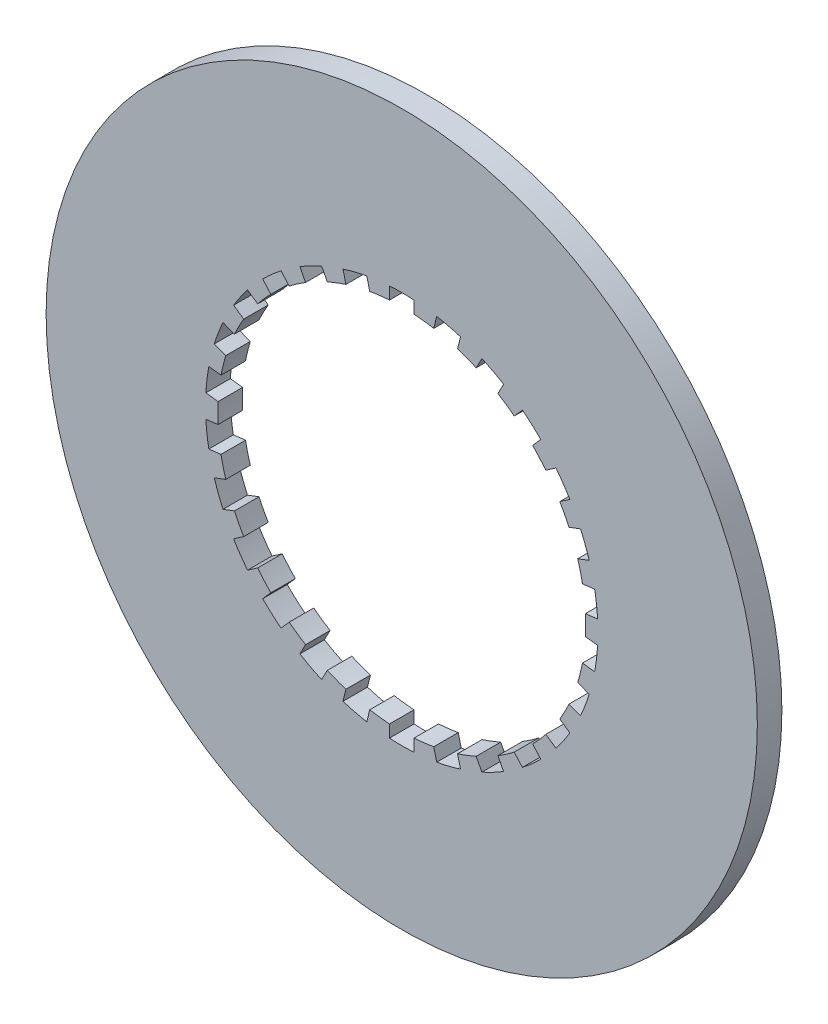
from build123d import *

# Parameters (mm, degrees)
EXTRUSION1_DEPTH             = 1
EXTRUSION1_DEPTH_BACK        = 1
ESQUISSE1_R                  = 29
ESQUISSE3_R                  = 15
ENL_V_MAT_EXTRU_1_DEPTH      = 42.060930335
ENL_V_MAT_EXTRU_2_DEPTH      = 2
R_P_TITION_CIRCULAIRE1_COUNT = 26


with BuildPart() as part:
    # Esquisse1 → Extrusion1 (new, two sides: drawn at the far end of the back side and taken through both)
    with BuildSketch(Plane.XY.offset(-EXTRUSION1_DEPTH_BACK)):
        Circle(ESQUISSE1_R)
    extrude(amount=EXTRUSION1_DEPTH + EXTRUSION1_DEPTH_BACK)

    # Esquisse3 → Enl_v. mat.-Extru.1 (cut, through all)
    with BuildSketch(Plane(origin=(0, 0, -1), x_dir=(-1, 0, 0), z_dir=(0, 0, -1))):
        Circle(ESQUISSE3_R)
    extrude(amount=-ENL_V_MAT_EXTRU_1_DEPTH, mode=Mode.SUBTRACT)

    # Esquisse4 → Enl_v. mat.-Extru.2 (cut)
    with BuildSketch(Plane.XY.offset(1)):
        with BuildLine():
            Line((-1, 14.966629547), (-0.611771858, 14.053088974))
            Line((-0.611771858, 14.053088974), (1, 14.966629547))
            Line((1, 14.966629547), (1, 15.968719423))
            ThreePointArc((1, 15.968719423), (0, 16), (-1, 15.968719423))
            Line((-1, 15.968719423), (-1, 14.966629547))
        make_face()
    enl_v_mat_extru_2 = extrude(amount=-ENL_V_MAT_EXTRU_2_DEPTH, mode=Mode.SUBTRACT)

    # R_p_tition circulaire1: Enl_v. mat.-Extru.2 ×26 about axis
    r_p_tition_circulaire1_axis = Axis((0, 0, 0), (0, 0, 1))
    for i in range(1, R_P_TITION_CIRCULAIRE1_COUNT):
        add(enl_v_mat_extru_2.rotate(r_p_tition_circulaire1_axis, i * 360 / R_P_TITION_CIRCULAIRE1_COUNT), mode=Mode.SUBTRACT)


solid = part.part
